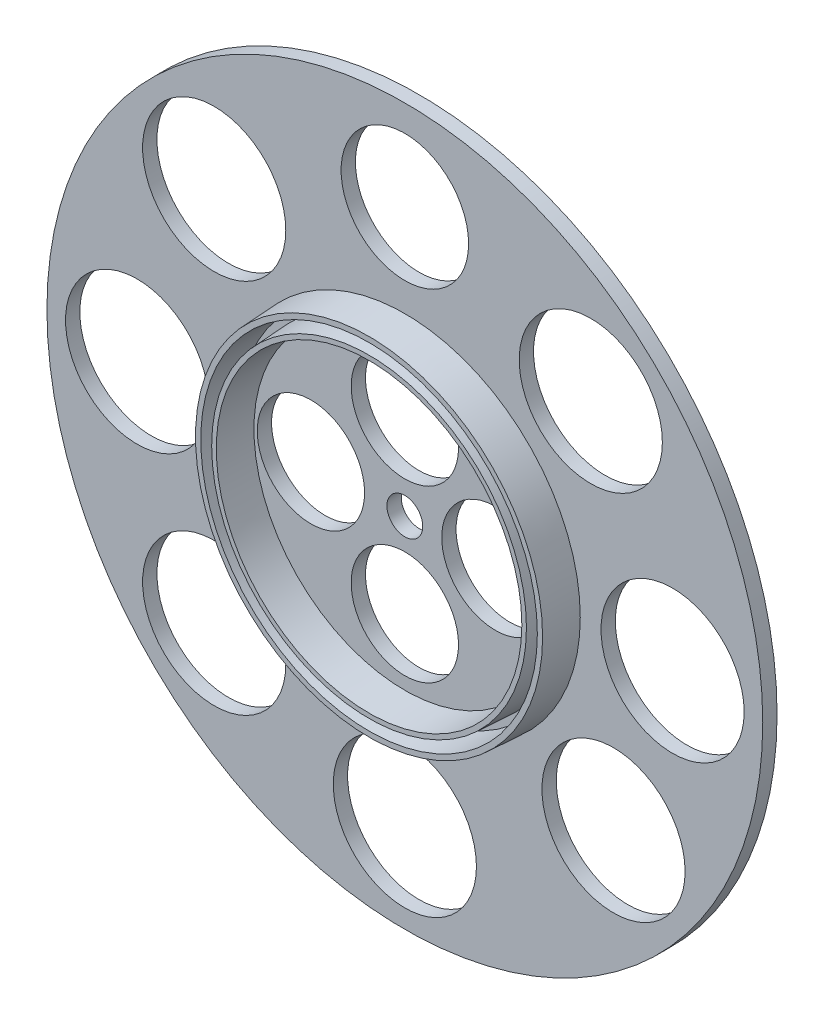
ISO-10303-21;
HEADER;
FILE_DESCRIPTION(('STEP AP214'),'2;1');
FILE_NAME('part.step','',(''),(''),'','','');
FILE_SCHEMA(('AUTOMOTIVE_DESIGN { 1 0 10303 214 1 1 1 1 }'));
ENDSEC;
DATA;
#1=APPLICATION_CONTEXT('core data for automotive mechanical design processes');
#2=APPLICATION_PROTOCOL_DEFINITION('international standard','automotive_design',2000,#1);
#3=PRODUCT_CONTEXT('',#1,'mechanical');
#4=PRODUCT('Part','Part','',(#3));
#5=PRODUCT_RELATED_PRODUCT_CATEGORY('part','',(#4));
#6=PRODUCT_DEFINITION_FORMATION('','',#4);
#7=PRODUCT_DEFINITION_CONTEXT('part definition',#1,'design');
#8=PRODUCT_DEFINITION('design','',#6,#7);
#9=PRODUCT_DEFINITION_SHAPE('','',#8);
#10=(LENGTH_UNIT() NAMED_UNIT(*) SI_UNIT(.MILLI.,.METRE.));
#11=(NAMED_UNIT(*) PLANE_ANGLE_UNIT() SI_UNIT($,.RADIAN.));
#12=(NAMED_UNIT(*) SI_UNIT($,.STERADIAN.) SOLID_ANGLE_UNIT());
#13=UNCERTAINTY_MEASURE_WITH_UNIT(LENGTH_MEASURE(1.E-05),#10,'distance_accuracy_value','');
#14=(GEOMETRIC_REPRESENTATION_CONTEXT(3) GLOBAL_UNCERTAINTY_ASSIGNED_CONTEXT((#13)) GLOBAL_UNIT_ASSIGNED_CONTEXT((#10,
#11,#12)) REPRESENTATION_CONTEXT('',''));
#15=CARTESIAN_POINT('',(0.,0.,0.));
#16=DIRECTION('',(0.,0.,1.));
#17=DIRECTION('',(1.,0.,0.));
#18=AXIS2_PLACEMENT_3D('',#15,#16,#17);
#19=CARTESIAN_POINT('',(0.,0.,2.));
#20=DIRECTION('',(0.,0.,1.));
#21=DIRECTION('',(1.,0.,0.));
#22=AXIS2_PLACEMENT_3D('',#19,#20,#21);
#23=PLANE('',#22);
#24=CARTESIAN_POINT('',(0.,0.,2.));
#25=DIRECTION('',(0.,0.,1.));
#26=DIRECTION('',(1.,0.,0.));
#27=AXIS2_PLACEMENT_3D('',#24,#25,#26);
#28=CIRCLE('',#27,23.25);
#29=CARTESIAN_POINT('',(23.25,0.,2.));
#30=VERTEX_POINT('',#29);
#31=EDGE_CURVE('E10',#30,#30,#28,.F.);
#32=ORIENTED_EDGE('',*,*,#31,.F.);
#33=EDGE_LOOP('',(#32));
#34=FACE_BOUND('',#33,.T.);
#35=CARTESIAN_POINT('',(0.,0.,2.));
#36=DIRECTION('',(0.,0.,1.));
#37=DIRECTION('',(1.,0.,0.));
#38=AXIS2_PLACEMENT_3D('',#35,#36,#37);
#39=CIRCLE('',#38,22.25);
#40=CARTESIAN_POINT('',(22.25,0.,2.));
#41=VERTEX_POINT('',#40);
#42=EDGE_CURVE('E55',#41,#41,#39,.T.);
#43=ORIENTED_EDGE('',*,*,#42,.F.);
#44=EDGE_LOOP('',(#43));
#45=FACE_BOUND('',#44,.T.);
#46=ADVANCED_FACE('F31',(#34,#45),#23,.T.);
#47=CARTESIAN_POINT('',(0.,0.,7.));
#48=DIRECTION('',(0.,0.,1.));
#49=DIRECTION('',(1.,0.,0.));
#50=AXIS2_PLACEMENT_3D('',#47,#48,#49);
#51=PLANE('',#50);
#52=CARTESIAN_POINT('',(0.,0.,7.));
#53=DIRECTION('',(0.,0.,1.));
#54=DIRECTION('',(1.,0.,0.));
#55=AXIS2_PLACEMENT_3D('',#52,#53,#54);
#56=CIRCLE('',#55,21.9879611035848);
#57=CARTESIAN_POINT('',(21.9879611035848,0.,7.));
#58=VERTEX_POINT('',#57);
#59=EDGE_CURVE('E50',#58,#58,#56,.T.);
#60=ORIENTED_EDGE('',*,*,#59,.T.);
#61=EDGE_LOOP('',(#60));
#62=FACE_BOUND('',#61,.T.);
#63=CARTESIAN_POINT('',(0.,0.,7.));
#64=DIRECTION('',(0.,0.,1.));
#65=DIRECTION('',(1.,0.,0.));
#66=AXIS2_PLACEMENT_3D('',#63,#64,#65);
#67=CIRCLE('',#66,21.3432440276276);
#68=CARTESIAN_POINT('',(21.3432440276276,0.,7.));
#69=VERTEX_POINT('',#68);
#70=EDGE_CURVE('E52',#69,#69,#67,.T.);
#71=ORIENTED_EDGE('',*,*,#70,.F.);
#72=EDGE_LOOP('',(#71));
#73=FACE_BOUND('',#72,.T.);
#74=ADVANCED_FACE('F190',(#62,#73),#51,.T.);
#75=CARTESIAN_POINT('',(0.,0.,2.));
#76=DIRECTION('',(0.,0.,-1.));
#77=DIRECTION('',(1.,0.,0.));
#78=AXIS2_PLACEMENT_3D('',#75,#76,#77);
#79=CONICAL_SURFACE('',#78,22.25,0.0523598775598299);
#80=ORIENTED_EDGE('',*,*,#59,.F.);
#81=EDGE_LOOP('',(#80));
#82=FACE_BOUND('',#81,.T.);
#83=ORIENTED_EDGE('',*,*,#42,.T.);
#84=EDGE_LOOP('',(#83));
#85=FACE_BOUND('',#84,.T.);
#86=ADVANCED_FACE('F195',(#82,#85),#79,.T.);
#87=CARTESIAN_POINT('',(0.,0.,2.));
#88=DIRECTION('',(0.,0.,1.));
#89=DIRECTION('',(1.,0.,0.));
#90=AXIS2_PLACEMENT_3D('',#87,#88,#89);
#91=CONICAL_SURFACE('',#90,21.0812051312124,0.0523598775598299);
#92=ORIENTED_EDGE('',*,*,#70,.T.);
#93=EDGE_LOOP('',(#92));
#94=FACE_BOUND('',#93,.T.);
#95=CARTESIAN_POINT('',(0.,0.,2.));
#96=DIRECTION('',(0.,0.,1.));
#97=DIRECTION('',(1.,0.,0.));
#98=AXIS2_PLACEMENT_3D('',#95,#96,#97);
#99=CIRCLE('',#98,21.0812051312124);
#100=CARTESIAN_POINT('',(21.0812051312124,0.,2.));
#101=VERTEX_POINT('',#100);
#102=EDGE_CURVE('E38',#101,#101,#99,.F.);
#103=ORIENTED_EDGE('',*,*,#102,.T.);
#104=EDGE_LOOP('',(#103));
#105=FACE_BOUND('',#104,.T.);
#106=ADVANCED_FACE('F162',(#94,#105),#91,.F.);
#107=CARTESIAN_POINT('',(12.6548488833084,0.,2.));
#108=DIRECTION('',(0.,0.,1.));
#109=DIRECTION('',(1.,0.,0.));
#110=AXIS2_PLACEMENT_3D('',#107,#108,#109);
#111=CIRCLE('',#110,7.5);
#112=CARTESIAN_POINT('',(20.1548488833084,0.,2.));
#113=VERTEX_POINT('',#112);
#114=EDGE_CURVE('E142',#113,#113,#111,.T.);
#115=ORIENTED_EDGE('',*,*,#114,.F.);
#116=EDGE_LOOP('',(#115));
#117=FACE_BOUND('',#116,.T.);
#118=CARTESIAN_POINT('',(-13.1235469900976,0.,2.));
#119=DIRECTION('',(0.,0.,1.));
#120=DIRECTION('',(1.,0.,0.));
#121=AXIS2_PLACEMENT_3D('',#118,#119,#120);
#122=CIRCLE('',#121,7.5);
#123=CARTESIAN_POINT('',(-5.62354699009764,0.,2.));
#124=VERTEX_POINT('',#123);
#125=EDGE_CURVE('E136',#124,#124,#122,.T.);
#126=ORIENTED_EDGE('',*,*,#125,.F.);
#127=EDGE_LOOP('',(#126));
#128=FACE_BOUND('',#127,.T.);
#129=CARTESIAN_POINT('',(0.,-11.8111922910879,2.));
#130=DIRECTION('',(0.,0.,1.));
#131=DIRECTION('',(1.,0.,0.));
#132=AXIS2_PLACEMENT_3D('',#129,#130,#131);
#133=CIRCLE('',#132,7.5);
#134=CARTESIAN_POINT('',(7.5,-11.8111922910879,2.));
#135=VERTEX_POINT('',#134);
#136=EDGE_CURVE('E130',#135,#135,#133,.T.);
#137=ORIENTED_EDGE('',*,*,#136,.F.);
#138=EDGE_LOOP('',(#137));
#139=FACE_BOUND('',#138,.T.);
#140=CARTESIAN_POINT('',(0.,11.9986715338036,2.));
#141=DIRECTION('',(0.,0.,1.));
#142=DIRECTION('',(1.,0.,0.));
#143=AXIS2_PLACEMENT_3D('',#140,#141,#142);
#144=CIRCLE('',#143,7.5);
#145=CARTESIAN_POINT('',(7.5,11.9986715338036,2.));
#146=VERTEX_POINT('',#145);
#147=EDGE_CURVE('E124',#146,#146,#144,.T.);
#148=ORIENTED_EDGE('',*,*,#147,.F.);
#149=EDGE_LOOP('',(#148));
#150=FACE_BOUND('',#149,.T.);
#151=CARTESIAN_POINT('',(0.,0.,2.));
#152=DIRECTION('',(0.,0.,1.));
#153=DIRECTION('',(1.,0.,0.));
#154=AXIS2_PLACEMENT_3D('',#151,#152,#153);
#155=CIRCLE('',#154,2.5);
#156=CARTESIAN_POINT('',(2.5,0.,2.));
#157=VERTEX_POINT('',#156);
#158=EDGE_CURVE('E70',#157,#157,#155,.T.);
#159=ORIENTED_EDGE('',*,*,#158,.F.);
#160=EDGE_LOOP('',(#159));
#161=FACE_BOUND('',#160,.T.);
#162=ORIENTED_EDGE('',*,*,#102,.F.);
#163=EDGE_LOOP('',(#162));
#164=FACE_BOUND('',#163,.T.);
#165=ADVANCED_FACE('F158',(#117,#128,#139,#150,#161,#164),#23,.T.);
#166=CARTESIAN_POINT('',(0.,0.,7.));
#167=DIRECTION('',(0.,0.,1.));
#168=DIRECTION('',(1.,0.,0.));
#169=AXIS2_PLACEMENT_3D('',#166,#167,#168);
#170=PLANE('',#169);
#171=CARTESIAN_POINT('',(0.,0.,7.));
#172=DIRECTION('',(0.,0.,1.));
#173=DIRECTION('',(1.,0.,0.));
#174=AXIS2_PLACEMENT_3D('',#171,#172,#173);
#175=CIRCLE('',#174,24.2456289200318);
#176=CARTESIAN_POINT('',(24.2456289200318,0.,7.));
#177=VERTEX_POINT('',#176);
#178=EDGE_CURVE('E56',#177,#177,#175,.T.);
#179=ORIENTED_EDGE('',*,*,#178,.T.);
#180=EDGE_LOOP('',(#179));
#181=FACE_BOUND('',#180,.T.);
#182=CARTESIAN_POINT('',(0.,0.,7.));
#183=DIRECTION('',(0.,0.,1.));
#184=DIRECTION('',(1.,0.,0.));
#185=AXIS2_PLACEMENT_3D('',#182,#183,#184);
#186=CIRCLE('',#185,23.5120388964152);
#187=CARTESIAN_POINT('',(23.5120388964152,0.,7.));
#188=VERTEX_POINT('',#187);
#189=EDGE_CURVE('E61',#188,#188,#186,.T.);
#190=ORIENTED_EDGE('',*,*,#189,.F.);
#191=EDGE_LOOP('',(#190));
#192=FACE_BOUND('',#191,.T.);
#193=ADVANCED_FACE('F161',(#181,#192),#170,.T.);
#194=CARTESIAN_POINT('',(0.,0.,2.));
#195=DIRECTION('',(0.,0.,-1.));
#196=DIRECTION('',(1.,0.,0.));
#197=AXIS2_PLACEMENT_3D('',#194,#195,#196);
#198=CONICAL_SURFACE('',#197,24.507667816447,0.0523598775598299);
#199=ORIENTED_EDGE('',*,*,#178,.F.);
#200=EDGE_LOOP('',(#199));
#201=FACE_BOUND('',#200,.T.);
#202=CARTESIAN_POINT('',(0.,0.,2.));
#203=DIRECTION('',(0.,0.,1.));
#204=DIRECTION('',(1.,0.,0.));
#205=AXIS2_PLACEMENT_3D('',#202,#203,#204);
#206=CIRCLE('',#205,24.507667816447);
#207=CARTESIAN_POINT('',(24.507667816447,0.,2.));
#208=VERTEX_POINT('',#207);
#209=EDGE_CURVE('E64',#208,#208,#206,.T.);
#210=ORIENTED_EDGE('',*,*,#209,.T.);
#211=EDGE_LOOP('',(#210));
#212=FACE_BOUND('',#211,.T.);
#213=ADVANCED_FACE('F208',(#201,#212),#198,.T.);
#214=CARTESIAN_POINT('',(0.,0.,2.));
#215=DIRECTION('',(0.,0.,1.));
#216=DIRECTION('',(1.,0.,0.));
#217=AXIS2_PLACEMENT_3D('',#214,#215,#216);
#218=CONICAL_SURFACE('',#217,23.25,0.0523598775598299);
#219=ORIENTED_EDGE('',*,*,#189,.T.);
#220=EDGE_LOOP('',(#219));
#221=FACE_BOUND('',#220,.T.);
#222=ORIENTED_EDGE('',*,*,#31,.T.);
#223=EDGE_LOOP('',(#222));
#224=FACE_BOUND('',#223,.T.);
#225=ADVANCED_FACE('F202',(#221,#224),#218,.F.);
#226=CARTESIAN_POINT('',(0.,0.,0.));
#227=DIRECTION('',(0.,0.,1.));
#228=DIRECTION('',(1.,0.,0.));
#229=AXIS2_PLACEMENT_3D('',#226,#227,#228);
#230=PLANE('',#229);
#231=CARTESIAN_POINT('',(12.6548488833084,0.,0.));
#232=DIRECTION('',(0.,0.,1.));
#233=DIRECTION('',(1.,0.,0.));
#234=AXIS2_PLACEMENT_3D('',#231,#232,#233);
#235=CIRCLE('',#234,7.5);
#236=CARTESIAN_POINT('',(20.1548488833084,0.,0.));
#237=VERTEX_POINT('',#236);
#238=EDGE_CURVE('E139',#237,#237,#235,.T.);
#239=ORIENTED_EDGE('',*,*,#238,.T.);
#240=EDGE_LOOP('',(#239));
#241=FACE_BOUND('',#240,.T.);
#242=CARTESIAN_POINT('',(-13.1235469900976,0.,0.));
#243=DIRECTION('',(0.,0.,1.));
#244=DIRECTION('',(1.,0.,0.));
#245=AXIS2_PLACEMENT_3D('',#242,#243,#244);
#246=CIRCLE('',#245,7.5);
#247=CARTESIAN_POINT('',(-5.62354699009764,0.,0.));
#248=VERTEX_POINT('',#247);
#249=EDGE_CURVE('E133',#248,#248,#246,.T.);
#250=ORIENTED_EDGE('',*,*,#249,.T.);
#251=EDGE_LOOP('',(#250));
#252=FACE_BOUND('',#251,.T.);
#253=CARTESIAN_POINT('',(0.,-11.8111922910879,0.));
#254=DIRECTION('',(0.,0.,1.));
#255=DIRECTION('',(1.,0.,0.));
#256=AXIS2_PLACEMENT_3D('',#253,#254,#255);
#257=CIRCLE('',#256,7.5);
#258=CARTESIAN_POINT('',(7.5,-11.8111922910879,0.));
#259=VERTEX_POINT('',#258);
#260=EDGE_CURVE('E127',#259,#259,#257,.T.);
#261=ORIENTED_EDGE('',*,*,#260,.T.);
#262=EDGE_LOOP('',(#261));
#263=FACE_BOUND('',#262,.T.);
#264=CARTESIAN_POINT('',(0.,11.9986715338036,0.));
#265=DIRECTION('',(0.,0.,1.));
#266=DIRECTION('',(1.,0.,0.));
#267=AXIS2_PLACEMENT_3D('',#264,#265,#266);
#268=CIRCLE('',#267,7.5);
#269=CARTESIAN_POINT('',(7.5,11.9986715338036,0.));
#270=VERTEX_POINT('',#269);
#271=EDGE_CURVE('E121',#270,#270,#268,.T.);
#272=ORIENTED_EDGE('',*,*,#271,.T.);
#273=EDGE_LOOP('',(#272));
#274=FACE_BOUND('',#273,.T.);
#275=CARTESIAN_POINT('',(-26.634184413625,-26.2590550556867,0.));
#276=DIRECTION('',(0.,0.,1.));
#277=DIRECTION('',(1.,0.,0.));
#278=AXIS2_PLACEMENT_3D('',#275,#276,#277);
#279=CIRCLE('',#278,10.);
#280=CARTESIAN_POINT('',(-16.634184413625,-26.2590550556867,0.));
#281=VERTEX_POINT('',#280);
#282=EDGE_CURVE('E115',#281,#281,#279,.T.);
#283=ORIENTED_EDGE('',*,*,#282,.T.);
#284=EDGE_LOOP('',(#283));
#285=FACE_BOUND('',#284,.T.);
#286=CARTESIAN_POINT('',(29.1511912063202,-23.433433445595,0.));
#287=DIRECTION('',(0.,0.,1.));
#288=DIRECTION('',(1.,0.,0.));
#289=AXIS2_PLACEMENT_3D('',#286,#287,#288);
#290=CIRCLE('',#289,10.);
#291=CARTESIAN_POINT('',(39.1511912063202,-23.433433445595,0.));
#292=VERTEX_POINT('',#291);
#293=EDGE_CURVE('E109',#292,#292,#290,.T.);
#294=ORIENTED_EDGE('',*,*,#293,.T.);
#295=EDGE_LOOP('',(#294));
#296=FACE_BOUND('',#295,.T.);
#297=CARTESIAN_POINT('',(25.9742789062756,26.9119785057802,0.));
#298=DIRECTION('',(0.,0.,1.));
#299=DIRECTION('',(1.,0.,0.));
#300=AXIS2_PLACEMENT_3D('',#297,#298,#299);
#301=CIRCLE('',#300,10.);
#302=CARTESIAN_POINT('',(35.9742789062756,26.9119785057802,0.));
#303=VERTEX_POINT('',#302);
#304=EDGE_CURVE('E103',#303,#303,#301,.T.);
#305=ORIENTED_EDGE('',*,*,#304,.T.);
#306=EDGE_LOOP('',(#305));
#307=FACE_BOUND('',#306,.T.);
#308=CARTESIAN_POINT('',(37.4021089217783,0.,0.));
#309=DIRECTION('',(0.,0.,1.));
#310=DIRECTION('',(1.,0.,0.));
#311=AXIS2_PLACEMENT_3D('',#308,#309,#310);
#312=CIRCLE('',#311,10.);
#313=CARTESIAN_POINT('',(47.4021089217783,0.,0.));
#314=VERTEX_POINT('',#313);
#315=EDGE_CURVE('E97',#314,#314,#312,.T.);
#316=ORIENTED_EDGE('',*,*,#315,.T.);
#317=EDGE_LOOP('',(#316));
#318=FACE_BOUND('',#317,.T.);
#319=CARTESIAN_POINT('',(0.,-37.4021089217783,0.));
#320=DIRECTION('',(0.,0.,1.));
#321=DIRECTION('',(1.,0.,0.));
#322=AXIS2_PLACEMENT_3D('',#319,#320,#321);
#323=CIRCLE('',#322,10.);
#324=CARTESIAN_POINT('',(10.,-37.4021089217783,0.));
#325=VERTEX_POINT('',#324);
#326=EDGE_CURVE('E91',#325,#325,#323,.T.);
#327=ORIENTED_EDGE('',*,*,#326,.T.);
#328=EDGE_LOOP('',(#327));
#329=FACE_BOUND('',#328,.T.);
#330=CARTESIAN_POINT('',(-37.4021089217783,0.,0.));
#331=DIRECTION('',(0.,0.,1.));
#332=DIRECTION('',(1.,0.,0.));
#333=AXIS2_PLACEMENT_3D('',#330,#331,#332);
#334=CIRCLE('',#333,10.);
#335=CARTESIAN_POINT('',(-27.4021089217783,0.,0.));
#336=VERTEX_POINT('',#335);
#337=EDGE_CURVE('E85',#336,#336,#334,.T.);
#338=ORIENTED_EDGE('',*,*,#337,.T.);
#339=EDGE_LOOP('',(#338));
#340=FACE_BOUND('',#339,.T.);
#341=CARTESIAN_POINT('',(-26.634184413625,26.2590550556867,0.));
#342=DIRECTION('',(0.,0.,1.));
#343=DIRECTION('',(1.,0.,0.));
#344=AXIS2_PLACEMENT_3D('',#341,#342,#343);
#345=CIRCLE('',#344,10.);
#346=CARTESIAN_POINT('',(-16.634184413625,26.2590550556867,0.));
#347=VERTEX_POINT('',#346);
#348=EDGE_CURVE('E79',#347,#347,#345,.T.);
#349=ORIENTED_EDGE('',*,*,#348,.T.);
#350=EDGE_LOOP('',(#349));
#351=FACE_BOUND('',#350,.T.);
#352=CARTESIAN_POINT('',(0.,37.4021089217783,0.));
#353=DIRECTION('',(0.,0.,1.));
#354=DIRECTION('',(1.,0.,0.));
#355=AXIS2_PLACEMENT_3D('',#352,#353,#354);
#356=CIRCLE('',#355,8.90674400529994);
#357=CARTESIAN_POINT('',(8.90674400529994,37.4021089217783,0.));
#358=VERTEX_POINT('',#357);
#359=EDGE_CURVE('E73',#358,#358,#356,.T.);
#360=ORIENTED_EDGE('',*,*,#359,.T.);
#361=EDGE_LOOP('',(#360));
#362=FACE_BOUND('',#361,.T.);
#363=CARTESIAN_POINT('',(0.,0.,0.));
#364=DIRECTION('',(0.,0.,1.));
#365=DIRECTION('',(1.,0.,0.));
#366=AXIS2_PLACEMENT_3D('',#363,#364,#365);
#367=CIRCLE('',#366,2.5);
#368=CARTESIAN_POINT('',(2.5,0.,0.));
#369=VERTEX_POINT('',#368);
#370=EDGE_CURVE('E65',#369,#369,#367,.T.);
#371=ORIENTED_EDGE('',*,*,#370,.T.);
#372=EDGE_LOOP('',(#371));
#373=FACE_BOUND('',#372,.T.);
#374=CARTESIAN_POINT('',(0.,0.,0.));
#375=DIRECTION('',(0.,0.,1.));
#376=DIRECTION('',(1.,0.,0.));
#377=AXIS2_PLACEMENT_3D('',#374,#375,#376);
#378=CIRCLE('',#377,50.);
#379=CARTESIAN_POINT('',(50.,0.,0.));
#380=VERTEX_POINT('',#379);
#381=EDGE_CURVE('E46',#380,#380,#378,.T.);
#382=ORIENTED_EDGE('',*,*,#381,.F.);
#383=EDGE_LOOP('',(#382));
#384=FACE_BOUND('',#383,.T.);
#385=ADVANCED_FACE('F148',(#241,#252,#263,#274,#285,#296,#307,#318,#329,#340,#351,#362,#373,
#384),#230,.F.);
#386=CARTESIAN_POINT('',(0.,0.,2.));
#387=DIRECTION('',(0.,0.,-1.));
#388=DIRECTION('',(-1.,0.,0.));
#389=AXIS2_PLACEMENT_3D('',#386,#387,#388);
#390=CYLINDRICAL_SURFACE('',#389,50.);
#391=CARTESIAN_POINT('',(0.,0.,2.));
#392=DIRECTION('',(0.,0.,1.));
#393=DIRECTION('',(1.,0.,0.));
#394=AXIS2_PLACEMENT_3D('',#391,#392,#393);
#395=CIRCLE('',#394,50.);
#396=CARTESIAN_POINT('',(50.,0.,2.));
#397=VERTEX_POINT('',#396);
#398=EDGE_CURVE('E42',#397,#397,#395,.T.);
#399=ORIENTED_EDGE('',*,*,#398,.F.);
#400=EDGE_LOOP('',(#399));
#401=FACE_BOUND('',#400,.T.);
#402=ORIENTED_EDGE('',*,*,#381,.T.);
#403=EDGE_LOOP('',(#402));
#404=FACE_BOUND('',#403,.T.);
#405=ADVANCED_FACE('F33',(#401,#404),#390,.T.);
#406=CARTESIAN_POINT('',(-26.634184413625,-26.2590550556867,2.));
#407=DIRECTION('',(0.,0.,1.));
#408=DIRECTION('',(1.,0.,0.));
#409=AXIS2_PLACEMENT_3D('',#406,#407,#408);
#410=CIRCLE('',#409,10.);
#411=CARTESIAN_POINT('',(-16.634184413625,-26.2590550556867,2.));
#412=VERTEX_POINT('',#411);
#413=EDGE_CURVE('E118',#412,#412,#410,.T.);
#414=ORIENTED_EDGE('',*,*,#413,.F.);
#415=EDGE_LOOP('',(#414));
#416=FACE_BOUND('',#415,.T.);
#417=CARTESIAN_POINT('',(29.1511912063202,-23.433433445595,2.));
#418=DIRECTION('',(0.,0.,1.));
#419=DIRECTION('',(1.,0.,0.));
#420=AXIS2_PLACEMENT_3D('',#417,#418,#419);
#421=CIRCLE('',#420,10.);
#422=CARTESIAN_POINT('',(39.1511912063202,-23.433433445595,2.));
#423=VERTEX_POINT('',#422);
#424=EDGE_CURVE('E112',#423,#423,#421,.T.);
#425=ORIENTED_EDGE('',*,*,#424,.F.);
#426=EDGE_LOOP('',(#425));
#427=FACE_BOUND('',#426,.T.);
#428=CARTESIAN_POINT('',(25.9742789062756,26.9119785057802,2.));
#429=DIRECTION('',(0.,0.,1.));
#430=DIRECTION('',(1.,0.,0.));
#431=AXIS2_PLACEMENT_3D('',#428,#429,#430);
#432=CIRCLE('',#431,10.);
#433=CARTESIAN_POINT('',(35.9742789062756,26.9119785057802,2.));
#434=VERTEX_POINT('',#433);
#435=EDGE_CURVE('E106',#434,#434,#432,.T.);
#436=ORIENTED_EDGE('',*,*,#435,.F.);
#437=EDGE_LOOP('',(#436));
#438=FACE_BOUND('',#437,.T.);
#439=CARTESIAN_POINT('',(37.4021089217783,0.,2.));
#440=DIRECTION('',(0.,0.,1.));
#441=DIRECTION('',(1.,0.,0.));
#442=AXIS2_PLACEMENT_3D('',#439,#440,#441);
#443=CIRCLE('',#442,10.);
#444=CARTESIAN_POINT('',(47.4021089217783,0.,2.));
#445=VERTEX_POINT('',#444);
#446=EDGE_CURVE('E100',#445,#445,#443,.T.);
#447=ORIENTED_EDGE('',*,*,#446,.F.);
#448=EDGE_LOOP('',(#447));
#449=FACE_BOUND('',#448,.T.);
#450=CARTESIAN_POINT('',(0.,-37.4021089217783,2.));
#451=DIRECTION('',(0.,0.,1.));
#452=DIRECTION('',(1.,0.,0.));
#453=AXIS2_PLACEMENT_3D('',#450,#451,#452);
#454=CIRCLE('',#453,10.);
#455=CARTESIAN_POINT('',(10.,-37.4021089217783,2.));
#456=VERTEX_POINT('',#455);
#457=EDGE_CURVE('E94',#456,#456,#454,.T.);
#458=ORIENTED_EDGE('',*,*,#457,.F.);
#459=EDGE_LOOP('',(#458));
#460=FACE_BOUND('',#459,.T.);
#461=CARTESIAN_POINT('',(-37.4021089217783,0.,2.));
#462=DIRECTION('',(0.,0.,1.));
#463=DIRECTION('',(1.,0.,0.));
#464=AXIS2_PLACEMENT_3D('',#461,#462,#463);
#465=CIRCLE('',#464,10.);
#466=CARTESIAN_POINT('',(-27.4021089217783,0.,2.));
#467=VERTEX_POINT('',#466);
#468=EDGE_CURVE('E88',#467,#467,#465,.T.);
#469=ORIENTED_EDGE('',*,*,#468,.F.);
#470=EDGE_LOOP('',(#469));
#471=FACE_BOUND('',#470,.T.);
#472=CARTESIAN_POINT('',(-26.634184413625,26.2590550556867,2.));
#473=DIRECTION('',(0.,0.,1.));
#474=DIRECTION('',(1.,0.,0.));
#475=AXIS2_PLACEMENT_3D('',#472,#473,#474);
#476=CIRCLE('',#475,10.);
#477=CARTESIAN_POINT('',(-16.634184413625,26.2590550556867,2.));
#478=VERTEX_POINT('',#477);
#479=EDGE_CURVE('E82',#478,#478,#476,.T.);
#480=ORIENTED_EDGE('',*,*,#479,.F.);
#481=EDGE_LOOP('',(#480));
#482=FACE_BOUND('',#481,.T.);
#483=CARTESIAN_POINT('',(0.,37.4021089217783,2.));
#484=DIRECTION('',(0.,0.,1.));
#485=DIRECTION('',(1.,0.,0.));
#486=AXIS2_PLACEMENT_3D('',#483,#484,#485);
#487=CIRCLE('',#486,8.90674400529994);
#488=CARTESIAN_POINT('',(8.90674400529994,37.4021089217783,2.));
#489=VERTEX_POINT('',#488);
#490=EDGE_CURVE('E76',#489,#489,#487,.T.);
#491=ORIENTED_EDGE('',*,*,#490,.F.);
#492=EDGE_LOOP('',(#491));
#493=FACE_BOUND('',#492,.T.);
#494=ORIENTED_EDGE('',*,*,#398,.T.);
#495=EDGE_LOOP('',(#494));
#496=FACE_BOUND('',#495,.T.);
#497=ORIENTED_EDGE('',*,*,#209,.F.);
#498=EDGE_LOOP('',(#497));
#499=FACE_BOUND('',#498,.T.);
#500=ADVANCED_FACE('F164',(#416,#427,#438,#449,#460,#471,#482,#493,#496,#499),#23,.T.);
#501=CARTESIAN_POINT('',(0.,0.,0.));
#502=DIRECTION('',(0.,0.,1.));
#503=DIRECTION('',(1.,0.,0.));
#504=AXIS2_PLACEMENT_3D('',#501,#502,#503);
#505=CYLINDRICAL_SURFACE('',#504,2.5);
#506=ORIENTED_EDGE('',*,*,#370,.F.);
#507=EDGE_LOOP('',(#506));
#508=FACE_BOUND('',#507,.T.);
#509=ORIENTED_EDGE('',*,*,#158,.T.);
#510=EDGE_LOOP('',(#509));
#511=FACE_BOUND('',#510,.T.);
#512=ADVANCED_FACE('F174',(#508,#511),#505,.F.);
#513=CARTESIAN_POINT('',(0.,37.4021089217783,0.));
#514=DIRECTION('',(0.,0.,1.));
#515=DIRECTION('',(1.,0.,0.));
#516=AXIS2_PLACEMENT_3D('',#513,#514,#515);
#517=CYLINDRICAL_SURFACE('',#516,8.90674400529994);
#518=ORIENTED_EDGE('',*,*,#359,.F.);
#519=EDGE_LOOP('',(#518));
#520=FACE_BOUND('',#519,.T.);
#521=ORIENTED_EDGE('',*,*,#490,.T.);
#522=EDGE_LOOP('',(#521));
#523=FACE_BOUND('',#522,.T.);
#524=ADVANCED_FACE('F176',(#520,#523),#517,.F.);
#525=CARTESIAN_POINT('',(-26.634184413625,26.2590550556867,0.));
#526=DIRECTION('',(0.,0.,1.));
#527=DIRECTION('',(1.,0.,0.));
#528=AXIS2_PLACEMENT_3D('',#525,#526,#527);
#529=CYLINDRICAL_SURFACE('',#528,10.);
#530=ORIENTED_EDGE('',*,*,#348,.F.);
#531=EDGE_LOOP('',(#530));
#532=FACE_BOUND('',#531,.T.);
#533=ORIENTED_EDGE('',*,*,#479,.T.);
#534=EDGE_LOOP('',(#533));
#535=FACE_BOUND('',#534,.T.);
#536=ADVANCED_FACE('F183',(#532,#535),#529,.F.);
#537=CARTESIAN_POINT('',(-37.4021089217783,0.,0.));
#538=DIRECTION('',(0.,0.,1.));
#539=DIRECTION('',(1.,0.,0.));
#540=AXIS2_PLACEMENT_3D('',#537,#538,#539);
#541=CYLINDRICAL_SURFACE('',#540,10.);
#542=ORIENTED_EDGE('',*,*,#337,.F.);
#543=EDGE_LOOP('',(#542));
#544=FACE_BOUND('',#543,.T.);
#545=ORIENTED_EDGE('',*,*,#468,.T.);
#546=EDGE_LOOP('',(#545));
#547=FACE_BOUND('',#546,.T.);
#548=ADVANCED_FACE('F267',(#544,#547),#541,.F.);
#549=CARTESIAN_POINT('',(0.,-37.4021089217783,0.));
#550=DIRECTION('',(0.,0.,1.));
#551=DIRECTION('',(1.,0.,0.));
#552=AXIS2_PLACEMENT_3D('',#549,#550,#551);
#553=CYLINDRICAL_SURFACE('',#552,10.);
#554=ORIENTED_EDGE('',*,*,#326,.F.);
#555=EDGE_LOOP('',(#554));
#556=FACE_BOUND('',#555,.T.);
#557=ORIENTED_EDGE('',*,*,#457,.T.);
#558=EDGE_LOOP('',(#557));
#559=FACE_BOUND('',#558,.T.);
#560=ADVANCED_FACE('F276',(#556,#559),#553,.F.);
#561=CARTESIAN_POINT('',(37.4021089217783,0.,0.));
#562=DIRECTION('',(0.,0.,1.));
#563=DIRECTION('',(1.,0.,0.));
#564=AXIS2_PLACEMENT_3D('',#561,#562,#563);
#565=CYLINDRICAL_SURFACE('',#564,10.);
#566=ORIENTED_EDGE('',*,*,#315,.F.);
#567=EDGE_LOOP('',(#566));
#568=FACE_BOUND('',#567,.T.);
#569=ORIENTED_EDGE('',*,*,#446,.T.);
#570=EDGE_LOOP('',(#569));
#571=FACE_BOUND('',#570,.T.);
#572=ADVANCED_FACE('F285',(#568,#571),#565,.F.);
#573=CARTESIAN_POINT('',(25.9742789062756,26.9119785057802,0.));
#574=DIRECTION('',(0.,0.,1.));
#575=DIRECTION('',(1.,0.,0.));
#576=AXIS2_PLACEMENT_3D('',#573,#574,#575);
#577=CYLINDRICAL_SURFACE('',#576,10.);
#578=ORIENTED_EDGE('',*,*,#304,.F.);
#579=EDGE_LOOP('',(#578));
#580=FACE_BOUND('',#579,.T.);
#581=ORIENTED_EDGE('',*,*,#435,.T.);
#582=EDGE_LOOP('',(#581));
#583=FACE_BOUND('',#582,.T.);
#584=ADVANCED_FACE('F294',(#580,#583),#577,.F.);
#585=CARTESIAN_POINT('',(29.1511912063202,-23.433433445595,0.));
#586=DIRECTION('',(0.,0.,1.));
#587=DIRECTION('',(1.,0.,0.));
#588=AXIS2_PLACEMENT_3D('',#585,#586,#587);
#589=CYLINDRICAL_SURFACE('',#588,10.);
#590=ORIENTED_EDGE('',*,*,#293,.F.);
#591=EDGE_LOOP('',(#590));
#592=FACE_BOUND('',#591,.T.);
#593=ORIENTED_EDGE('',*,*,#424,.T.);
#594=EDGE_LOOP('',(#593));
#595=FACE_BOUND('',#594,.T.);
#596=ADVANCED_FACE('F303',(#592,#595),#589,.F.);
#597=CARTESIAN_POINT('',(-26.634184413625,-26.2590550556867,0.));
#598=DIRECTION('',(0.,0.,1.));
#599=DIRECTION('',(1.,0.,0.));
#600=AXIS2_PLACEMENT_3D('',#597,#598,#599);
#601=CYLINDRICAL_SURFACE('',#600,10.);
#602=ORIENTED_EDGE('',*,*,#282,.F.);
#603=EDGE_LOOP('',(#602));
#604=FACE_BOUND('',#603,.T.);
#605=ORIENTED_EDGE('',*,*,#413,.T.);
#606=EDGE_LOOP('',(#605));
#607=FACE_BOUND('',#606,.T.);
#608=ADVANCED_FACE('F312',(#604,#607),#601,.F.);
#609=CARTESIAN_POINT('',(0.,11.9986715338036,0.));
#610=DIRECTION('',(0.,0.,1.));
#611=DIRECTION('',(1.,0.,0.));
#612=AXIS2_PLACEMENT_3D('',#609,#610,#611);
#613=CYLINDRICAL_SURFACE('',#612,7.5);
#614=ORIENTED_EDGE('',*,*,#271,.F.);
#615=EDGE_LOOP('',(#614));
#616=FACE_BOUND('',#615,.T.);
#617=ORIENTED_EDGE('',*,*,#147,.T.);
#618=EDGE_LOOP('',(#617));
#619=FACE_BOUND('',#618,.T.);
#620=ADVANCED_FACE('F321',(#616,#619),#613,.F.);
#621=CARTESIAN_POINT('',(0.,-11.8111922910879,0.));
#622=DIRECTION('',(0.,0.,1.));
#623=DIRECTION('',(1.,0.,0.));
#624=AXIS2_PLACEMENT_3D('',#621,#622,#623);
#625=CYLINDRICAL_SURFACE('',#624,7.5);
#626=ORIENTED_EDGE('',*,*,#260,.F.);
#627=EDGE_LOOP('',(#626));
#628=FACE_BOUND('',#627,.T.);
#629=ORIENTED_EDGE('',*,*,#136,.T.);
#630=EDGE_LOOP('',(#629));
#631=FACE_BOUND('',#630,.T.);
#632=ADVANCED_FACE('F330',(#628,#631),#625,.F.);
#633=CARTESIAN_POINT('',(-13.1235469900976,0.,0.));
#634=DIRECTION('',(0.,0.,1.));
#635=DIRECTION('',(1.,0.,0.));
#636=AXIS2_PLACEMENT_3D('',#633,#634,#635);
#637=CYLINDRICAL_SURFACE('',#636,7.5);
#638=ORIENTED_EDGE('',*,*,#249,.F.);
#639=EDGE_LOOP('',(#638));
#640=FACE_BOUND('',#639,.T.);
#641=ORIENTED_EDGE('',*,*,#125,.T.);
#642=EDGE_LOOP('',(#641));
#643=FACE_BOUND('',#642,.T.);
#644=ADVANCED_FACE('F154',(#640,#643),#637,.F.);
#645=CARTESIAN_POINT('',(12.6548488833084,0.,0.));
#646=DIRECTION('',(0.,0.,1.));
#647=DIRECTION('',(1.,0.,0.));
#648=AXIS2_PLACEMENT_3D('',#645,#646,#647);
#649=CYLINDRICAL_SURFACE('',#648,7.5);
#650=ORIENTED_EDGE('',*,*,#238,.F.);
#651=EDGE_LOOP('',(#650));
#652=FACE_BOUND('',#651,.T.);
#653=ORIENTED_EDGE('',*,*,#114,.T.);
#654=EDGE_LOOP('',(#653));
#655=FACE_BOUND('',#654,.T.);
#656=ADVANCED_FACE('F151',(#652,#655),#649,.F.);
#657=CLOSED_SHELL('',(#46,#74,#86,#106,#165,#193,#213,#225,#385,#405,#500,#512,#524,#536,#548,
#560,#572,#584,#596,#608,#620,#632,#644,#656));
#658=MANIFOLD_SOLID_BREP('B2',#657);
#659=ADVANCED_BREP_SHAPE_REPRESENTATION('',(#18,#658),#14);
#660=SHAPE_DEFINITION_REPRESENTATION(#9,#659);
ENDSEC;
END-ISO-10303-21;
